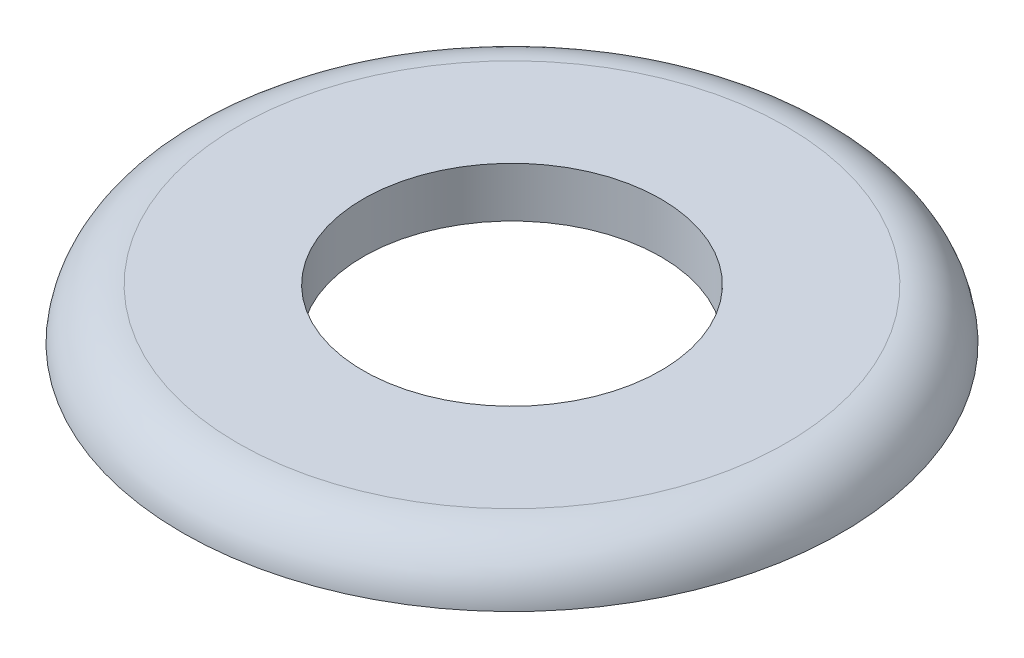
ISO-10303-21;
HEADER;
FILE_DESCRIPTION(('STEP AP214'),'2;1');
FILE_NAME('part.step','',(''),(''),'','','');
FILE_SCHEMA(('AUTOMOTIVE_DESIGN { 1 0 10303 214 1 1 1 1 }'));
ENDSEC;
DATA;
#1=APPLICATION_CONTEXT('core data for automotive mechanical design processes');
#2=APPLICATION_PROTOCOL_DEFINITION('international standard','automotive_design',2000,#1);
#3=PRODUCT_CONTEXT('',#1,'mechanical');
#4=PRODUCT('Part','Part','',(#3));
#5=PRODUCT_RELATED_PRODUCT_CATEGORY('part','',(#4));
#6=PRODUCT_DEFINITION_FORMATION('','',#4);
#7=PRODUCT_DEFINITION_CONTEXT('part definition',#1,'design');
#8=PRODUCT_DEFINITION('design','',#6,#7);
#9=PRODUCT_DEFINITION_SHAPE('','',#8);
#10=(LENGTH_UNIT() NAMED_UNIT(*) SI_UNIT(.MILLI.,.METRE.));
#11=(NAMED_UNIT(*) PLANE_ANGLE_UNIT() SI_UNIT($,.RADIAN.));
#12=(NAMED_UNIT(*) SI_UNIT($,.STERADIAN.) SOLID_ANGLE_UNIT());
#13=UNCERTAINTY_MEASURE_WITH_UNIT(LENGTH_MEASURE(1.E-05),#10,'distance_accuracy_value','');
#14=(GEOMETRIC_REPRESENTATION_CONTEXT(3) GLOBAL_UNCERTAINTY_ASSIGNED_CONTEXT((#13)) GLOBAL_UNIT_ASSIGNED_CONTEXT((#10,
#11,#12)) REPRESENTATION_CONTEXT('',''));
#15=CARTESIAN_POINT('',(0.,0.,0.));
#16=DIRECTION('',(0.,0.,1.));
#17=DIRECTION('',(1.,0.,0.));
#18=AXIS2_PLACEMENT_3D('',#15,#16,#17);
#19=CARTESIAN_POINT('',(0.,4.9609375,0.));
#20=DIRECTION('',(0.,-1.,0.));
#21=DIRECTION('',(0.,0.,-1.));
#22=AXIS2_PLACEMENT_3D('',#19,#20,#21);
#23=TOROIDAL_SURFACE('',#22,3.7703125,0.7635875);
#24=CARTESIAN_POINT('',(0.,5.724525,0.));
#25=DIRECTION('',(0.,-1.,0.));
#26=DIRECTION('',(0.,0.,-1.));
#27=AXIS2_PLACEMENT_3D('',#24,#25,#26);
#28=CIRCLE('',#27,3.7703125);
#29=CARTESIAN_POINT('',(0.,5.724525,-3.7703125));
#30=VERTEX_POINT('',#29);
#31=EDGE_CURVE('E51',#30,#30,#28,.T.);
#32=ORIENTED_EDGE('',*,*,#31,.T.);
#33=EDGE_LOOP('',(#32));
#34=FACE_BOUND('',#33,.T.);
#35=CARTESIAN_POINT('',(0.,5.0371375,0.));
#36=DIRECTION('',(0.,-1.,0.));
#37=DIRECTION('',(0.,0.,-1.));
#38=AXIS2_PLACEMENT_3D('',#35,#36,#37);
#39=CIRCLE('',#38,4.53008840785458);
#40=CARTESIAN_POINT('',(0.,5.0371375,-4.53008840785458));
#41=VERTEX_POINT('',#40);
#42=EDGE_CURVE('E11',#41,#41,#39,.T.);
#43=ORIENTED_EDGE('',*,*,#42,.F.);
#44=EDGE_LOOP('',(#43));
#45=FACE_BOUND('',#44,.T.);
#46=ADVANCED_FACE('F17',(#34,#45),#23,.T.);
#47=CARTESIAN_POINT('',(0.,5.0371375,0.));
#48=DIRECTION('',(0.,-1.,0.));
#49=DIRECTION('',(0.,0.,-1.));
#50=AXIS2_PLACEMENT_3D('',#47,#48,#49);
#51=CYLINDRICAL_SURFACE('',#50,2.04542483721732);
#52=CARTESIAN_POINT('',(0.,5.724525,0.));
#53=DIRECTION('',(0.,-1.,0.));
#54=DIRECTION('',(0.,0.,-1.));
#55=AXIS2_PLACEMENT_3D('',#52,#53,#54);
#56=CIRCLE('',#55,2.04542483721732);
#57=CARTESIAN_POINT('',(0.,5.724525,-2.04542483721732));
#58=VERTEX_POINT('',#57);
#59=EDGE_CURVE('E55',#58,#58,#56,.T.);
#60=ORIENTED_EDGE('',*,*,#59,.F.);
#61=EDGE_LOOP('',(#60));
#62=FACE_BOUND('',#61,.T.);
#63=CARTESIAN_POINT('',(0.,5.0371375,0.));
#64=DIRECTION('',(0.,-1.,0.));
#65=DIRECTION('',(0.,0.,-1.));
#66=AXIS2_PLACEMENT_3D('',#63,#64,#65);
#67=CIRCLE('',#66,2.04542483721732);
#68=CARTESIAN_POINT('',(0.,5.0371375,-2.04542483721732));
#69=VERTEX_POINT('',#68);
#70=EDGE_CURVE('E20',#69,#69,#67,.T.);
#71=ORIENTED_EDGE('',*,*,#70,.T.);
#72=EDGE_LOOP('',(#71));
#73=FACE_BOUND('',#72,.T.);
#74=ADVANCED_FACE('F77',(#62,#73),#51,.F.);
#75=CARTESIAN_POINT('',(0.,5.0371375,-2.04542483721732));
#76=DIRECTION('',(0.,-1.,0.));
#77=DIRECTION('',(0.,0.,-1.));
#78=AXIS2_PLACEMENT_3D('',#75,#76,#77);
#79=PLANE('',#78);
#80=ORIENTED_EDGE('',*,*,#42,.T.);
#81=EDGE_LOOP('',(#80));
#82=FACE_BOUND('',#81,.T.);
#83=ORIENTED_EDGE('',*,*,#70,.F.);
#84=EDGE_LOOP('',(#83));
#85=FACE_BOUND('',#84,.T.);
#86=ADVANCED_FACE('F72',(#82,#85),#79,.T.);
#87=CARTESIAN_POINT('',(0.,5.724525,-3.7703125));
#88=DIRECTION('',(0.,1.,0.));
#89=DIRECTION('',(1.,0.,0.));
#90=AXIS2_PLACEMENT_3D('',#87,#88,#89);
#91=PLANE('',#90);
#92=ORIENTED_EDGE('',*,*,#59,.T.);
#93=EDGE_LOOP('',(#92));
#94=FACE_BOUND('',#93,.T.);
#95=ORIENTED_EDGE('',*,*,#31,.F.);
#96=EDGE_LOOP('',(#95));
#97=FACE_BOUND('',#96,.T.);
#98=ADVANCED_FACE('F67',(#94,#97),#91,.T.);
#99=CLOSED_SHELL('',(#46,#74,#86,#98));
#100=MANIFOLD_SOLID_BREP('B1',#99);
#101=ADVANCED_BREP_SHAPE_REPRESENTATION('',(#18,#100),#14);
#102=SHAPE_DEFINITION_REPRESENTATION(#9,#101);
ENDSEC;
END-ISO-10303-21;
